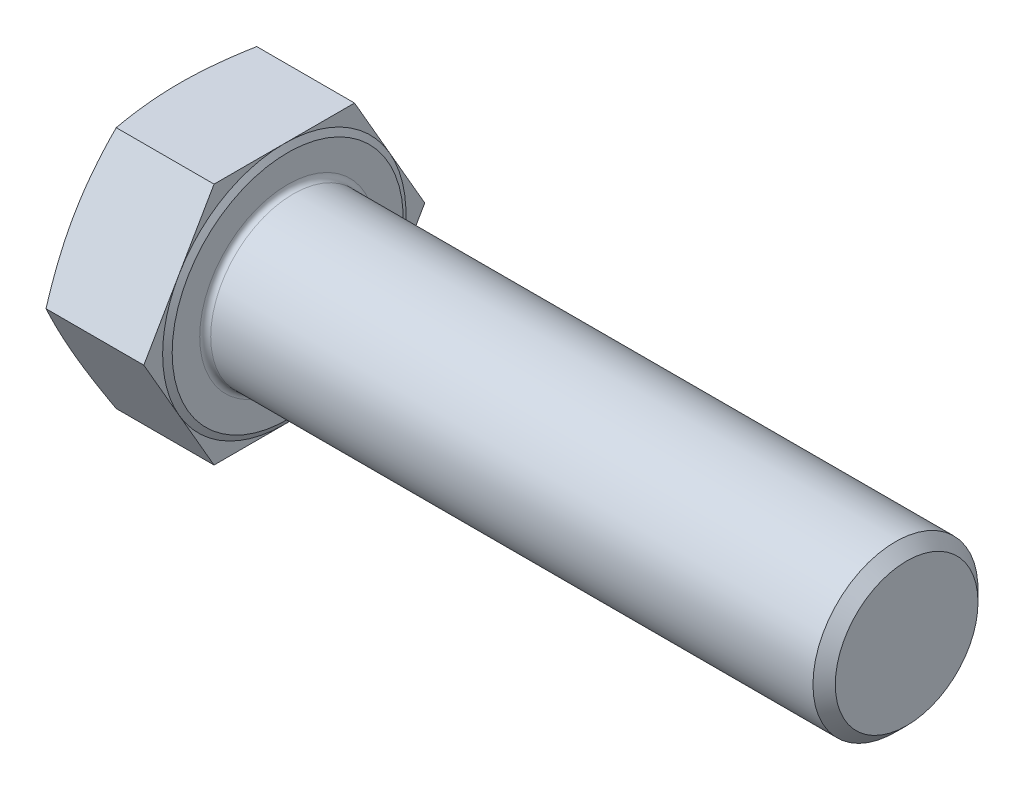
from build123d import *

# Parameters (mm, degrees)
BASEHEAD_DEPTH = 15.22
SKETCH3_R      = 12
BASEBODY_DEPTH = 90
HEADFILLET_R   = 0.8
CHAMFER1_SIZE  = 1.624


with BuildPart() as part:
    # Sketch-BaseHead → BaseHead (new body)
    with BuildSketch(Plane(origin=(0, 0, 0), x_dir=(0, 0, -1), z_dir=(1, 0, 0))):
        Polygon((20.426652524, 0), (10.213326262, 17.69), (-10.213326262, 17.69), (-20.426652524, 0), (-10.213326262, -17.69), (10.213326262, -17.69), align=None)
    extrude(amount=BASEHEAD_DEPTH)

    # Sketch4 → HeadChamfer (revolve, cut)
    with BuildSketch(Plane(origin=(-0.264637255, 0, 5.916896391), x_dir=(0, 0, -1), z_dir=(0, 1, 0))):
        Polygon((26.343548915, -0.264637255), (23.606896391, -0.264637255), (26.343548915, -1.260697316), align=None)
    revolve(axis=Axis((-4.001564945, 0, 0), (1, 0, 0)), mode=Mode.SUBTRACT)

    # Sketch1 → Revolve1 (revolve)
    with BuildSketch(Plane.XY, mode=Mode.PRIVATE) as revolve1_sk:
        Polygon((15.22, 0), (15.72, 0), (15.72, -16.805), (15.22, -17.69), align=None)
    revolve(revolve1_sk.sketch.rotate(Axis((-4.001564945, 0, 0), (1, 0, 0)), 270), axis=Axis((-4.001564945, 0, 0), (1, 0, 0)))

    # Sketch3 → BaseBody (add)
    with BuildSketch(Plane(origin=(15.72, 0, 0), x_dir=(0, 0, -1), z_dir=(1, 0, 0))):
        with Locations(Location((0, 0, 0), (0, 0, 180))):
            Circle(SKETCH3_R)
    extrude(amount=BASEBODY_DEPTH)

    # HeadFillet
    headfillet_edges = [part.edges().sort_by_distance(p)[0] for p in [
        (15.72, 0, -12),
    ]]
    fillet(headfillet_edges, radius=HEADFILLET_R)

    # Chamfer1
    chamfer1_edges = [part.edges().sort_by_distance(p)[0] for p in [
        (105.72, 0, -12),
    ]]
    chamfer(chamfer1_edges, length=CHAMFER1_SIZE)


solid = part.part
